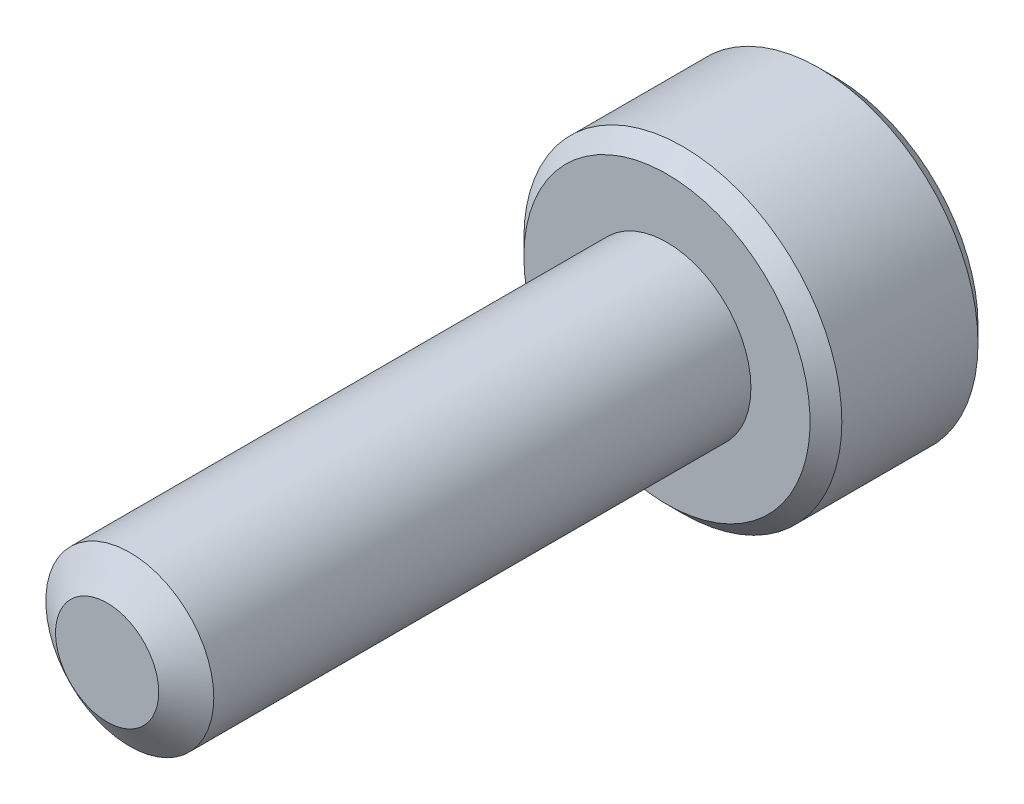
from build123d import *

# Parameters (mm, degrees)
SKETCH1_R          = 1.5
EXTRUDE1_DEPTH     = 10
SKETCH6_R          = 2.84
EXTRUDE2_DEPTH     = 3
CUT_EXTRUDE1_DEPTH = 1.875
CHAMFER1_SIZE      = 0.284


with BuildPart() as part:
    # Sketch1 → Extrude1 (new body)
    with BuildSketch(Plane.XY):
        Circle(SKETCH1_R)
    extrude(amount=-EXTRUDE1_DEPTH)

    # Sketch4 → Cut-Revolve1 (revolve, cut)
    with BuildSketch(Plane(origin=(0, 0, 0), x_dir=(0, 0, -1), z_dir=(1, 0, 0)), mode=Mode.PRIVATE) as cut_revolve1_sk:
        Polygon((0.405251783, 1.5), (0, 0.921240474), (0, 1.5), align=None)
    revolve(cut_revolve1_sk.sketch.rotate(Axis((0, 0, 0), (0, 0, -1)), 90), axis=Axis((0, 0, 0), (0, 0, -1)), mode=Mode.SUBTRACT)

    # Sketch6 → Extrude2 (add)
    with BuildSketch(Plane(origin=(0, 0, -10), x_dir=(-1, 0, 0), z_dir=(0, 0, -1))):
        Circle(SKETCH6_R)
    extrude(amount=EXTRUDE2_DEPTH)

    # Sketch7 → Cut-Extrude1 (cut)
    with BuildSketch(Plane(origin=(0, 0, -13), x_dir=(-1, 0, 0), z_dir=(0, 0, -1))):
        Polygon((0, 1.443375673), (-1.25, 0.721687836), (-1.25, -0.721687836), (0, -1.443375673), (1.25, -0.721687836), (1.25, 0.721687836), align=None)
    extrude(amount=-CUT_EXTRUDE1_DEPTH, mode=Mode.SUBTRACT)

    # Cut-Extrude2 cone 1 section (on through the dimple's axis) → Cut-Extrude2 (revolve, cut)
    with BuildSketch(Plane(origin=(0, 0, -13), x_dir=(0, 1, 0), z_dir=(1, 0, 0))):
        Polygon((0, 0), (1.443375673, 0), (0, 1.443375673), align=None)
    revolve(axis=Axis((0, 0, -13), (0, 0, 1)), mode=Mode.SUBTRACT)

    # Chamfer1
    chamfer1_edges = [part.edges().sort_by_distance(p)[0] for p in [
        (2.84, 0, -10),
        (2.84, 0, -13),
    ]]
    chamfer(chamfer1_edges, length=CHAMFER1_SIZE)


solid = part.part
